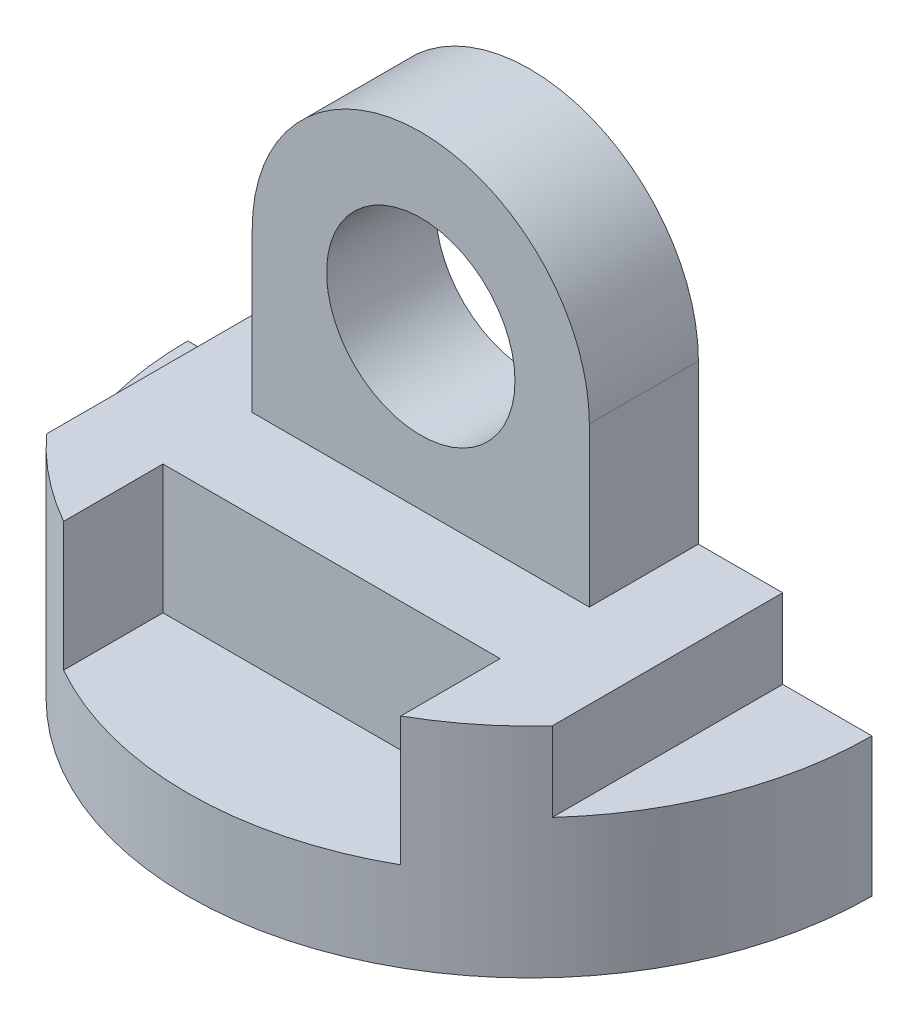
from build123d import *

# Parameters (mm, degrees)
EXTRUDE_1_DEPTH     = 88
EXTRUDE_2_DEPTH     = 44
SKETCH_3_R          = 38
CUT_EXTRUDE_3_DEPTH = 277.188341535
SKETCH_4_W          = 136
SKETCH_4_H          = 77.940213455
CUT_EXTRUDE_4_DEPTH = 52
SKETCH_5_W          = 54.848614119
SKETCH_5_H          = 114.548495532
CUT_EXTRUDE_5_DEPTH = 32


with BuildPart() as part:
    # Sketch 1 → Extrude 1 (new body)
    with BuildSketch(Plane(origin=(0, 0, 0), x_dir=(1, 0, 0), z_dir=(0, 1, 0))):
        with BuildLine():
            Line((138, 0), (-138, 0))
            ThreePointArc((-138, 0), (0, -138), (138, 0))
        make_face()
    extrude(amount=EXTRUDE_1_DEPTH)

    # Sketch 2 → Extrude 2 (add)
    with BuildSketch(Plane.XY):
        with BuildLine():
            Line((68, 88), (-68, 88))
            Line((-68, 88), (-68, 152))
            ThreePointArc((-68, 152), (0, 220), (68, 152))
            Line((68, 152), (68, 88))
        make_face()
    extrude(amount=EXTRUDE_2_DEPTH)

    # Sketch 3 → Cut-Extrude 3 (cut, through all)
    with BuildSketch(Plane.XY.offset(44)):
        with Locations((0, 152)):
            Circle(SKETCH_3_R)
    extrude(amount=-CUT_EXTRUDE_3_DEPTH, mode=Mode.SUBTRACT)

    # Sketch 4 → Cut-Extrude 4 (cut)
    with BuildSketch(Plane(origin=(0, 88, 0), x_dir=(1, 0, 0), z_dir=(0, 1, 0))):
        with Locations((0, -118.970106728)):
            Rectangle(SKETCH_4_W, SKETCH_4_H)
    extrude(amount=-CUT_EXTRUDE_4_DEPTH, mode=Mode.SUBTRACT)

    # Sketch 5 → Cut-Extrude 5 (cut)
    with BuildSketch(Plane(origin=(0, 88, 0), x_dir=(1, 0, 0), z_dir=(0, 1, 0))):
        with Locations((-129.424307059, -47.153096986)):
            Rectangle(SKETCH_5_W, SKETCH_5_H)
    cut_extrude_5 = extrude(amount=-CUT_EXTRUDE_5_DEPTH, mode=Mode.SUBTRACT)

    # Mirror 1: Cut-Extrude 5 across plane
    add(cut_extrude_5.mirror(Plane(origin=(0, 0, 0), x_dir=(0, 0, 1), z_dir=(1, 0, 0))), mode=Mode.SUBTRACT)


solid = part.part
